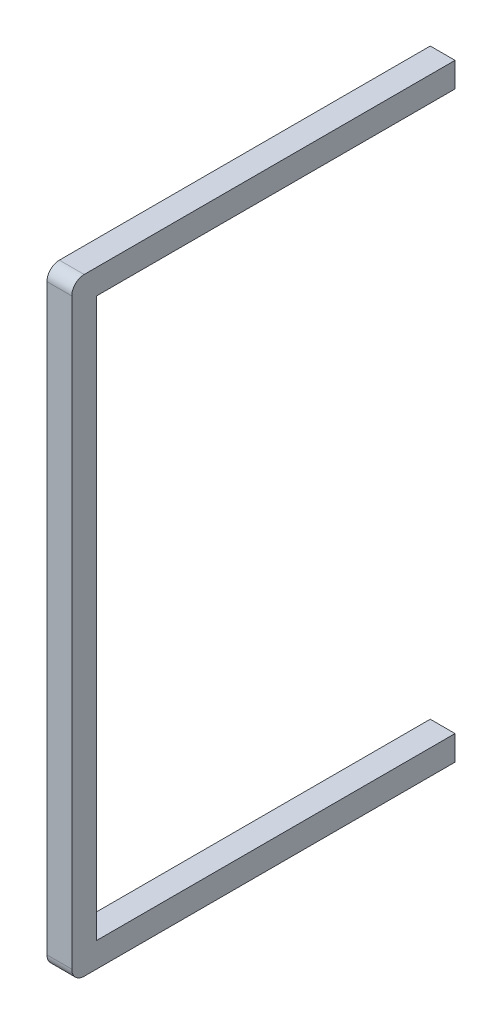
from build123d import *

# Parameters (mm, degrees)
SKETCH3_W           = 1
SKETCH3_H           = 24.5
BOSS_EXTRUDE1_DEPTH = 1
SKETCH4_W           = 1
SKETCH4_H           = 1
BOSS_EXTRUDE2_DEPTH = 14.45
FILLET1_R           = 0.5


with BuildPart() as part:
    # Sketch3 → Boss-Extrude1 (new body)
    with BuildSketch(Plane.XY):
        with Locations((-1518.837155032, 32.385335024)):
            Rectangle(SKETCH3_W, SKETCH3_H)
    extrude(amount=BOSS_EXTRUDE1_DEPTH)

    # Sketch4 → Boss-Extrude2 (add)
    with BuildSketch(Plane(origin=(0, 0, 0), x_dir=(-1, 0, 0), z_dir=(0, 0, -1))):
        with Locations((1518.837155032, 44.135335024)):
            Rectangle(SKETCH4_W, SKETCH4_H)
        with Locations((1518.837155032, 20.635335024)):
            Rectangle(SKETCH4_W, SKETCH4_H)
    extrude(amount=BOSS_EXTRUDE2_DEPTH)

    # Fillet1
    fillet1_edges = [part.edges().sort_by_distance(p)[0] for p in [
        (-1518.837155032, 44.635335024, 1),
        (-1518.837155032, 20.135335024, 1),
    ]]
    fillet(fillet1_edges, radius=FILLET1_R)


solid = part.part
